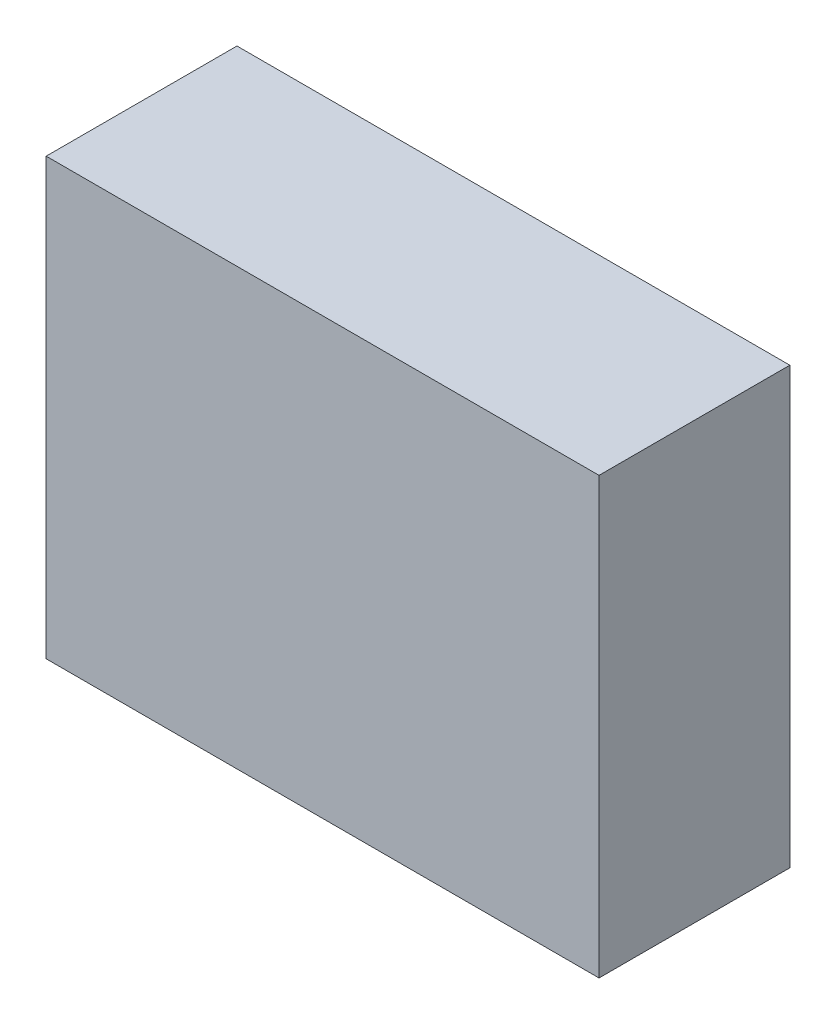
from build123d import *

# Parameters (mm, degrees)
GENERAL_W           = 5.08
GENERAL_H           = 4
BOSS_EXTRUDE1_DEPTH = 1.753


with BuildPart() as part:
    # GENERAL → Boss-Extrude1 (new body)
    with BuildSketch(Plane.XY):
        Rectangle(GENERAL_W, GENERAL_H)
    extrude(amount=BOSS_EXTRUDE1_DEPTH)


solid = part.part
